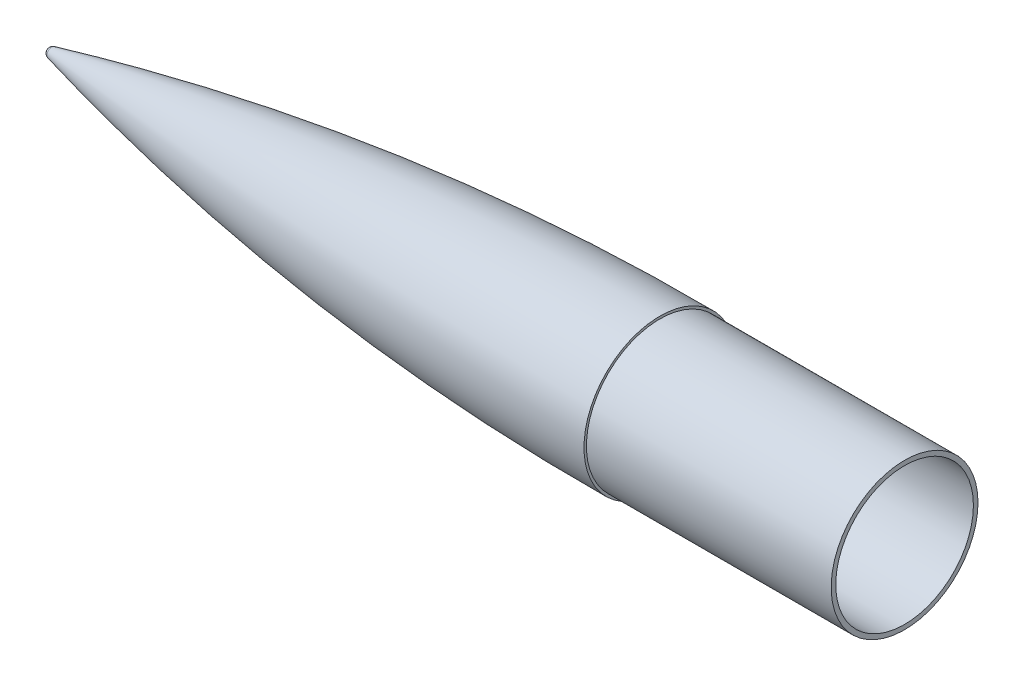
from build123d import *


with BuildPart() as part:
    # Sketch1 → Revolve1 (revolve)
    with BuildSketch(Plane.XY, mode=Mode.PRIVATE) as revolve1_sk:
        with BuildLine():
            Line((325.525034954, 38.1), (452.525034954, 38.1))
            Line((452.525034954, 38.1), (452.525034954, 35.71875))
            Line((452.525034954, 35.71875), (325.525034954, 35.71875))
            Line((325.525034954, 35.71875), (325.510697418, 36.988793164))
            ThreePointArc((325.510697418, 36.988793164), (166.566791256, 28.186849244), (9.894709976, 0))
            Line((9.894709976, 0), (8.025034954, 0))
            ThreePointArc((8.025034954, 0), (8.567797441, 1.569280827), (9.964123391, 2.467894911))
            ThreePointArc((9.964123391, 2.467894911), (166.61365154, 30.589847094), (325.525034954, 39.37))
            Line((325.525034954, 39.37), (325.525034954, 38.1))
        make_face()
    revolve(revolve1_sk.sketch.rotate(Axis((325.525034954, 0, 0), (-1, 0, 0)), 90), axis=Axis((325.525034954, 0, 0), (-1, 0, 0)))


solid = part.part
